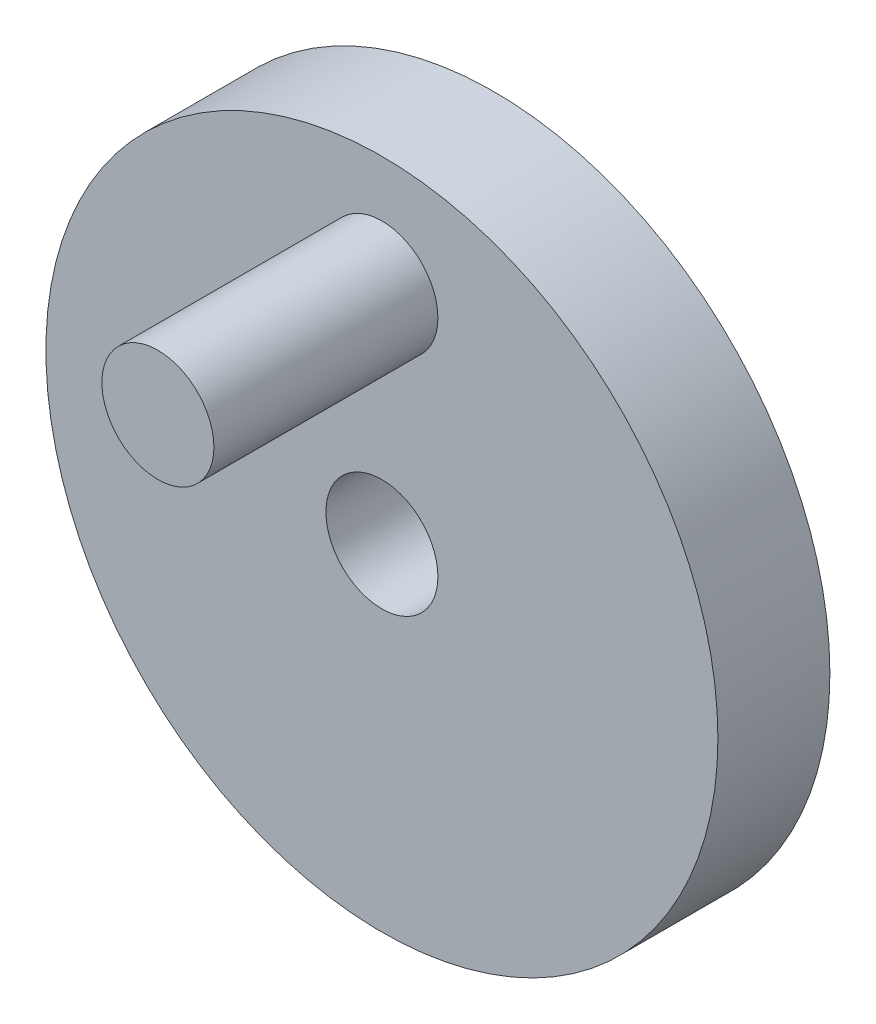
ISO-10303-21;
HEADER;
FILE_DESCRIPTION(('STEP AP214'),'2;1');
FILE_NAME('part.step','',(''),(''),'','','');
FILE_SCHEMA(('AUTOMOTIVE_DESIGN { 1 0 10303 214 1 1 1 1 }'));
ENDSEC;
DATA;
#1=APPLICATION_CONTEXT('core data for automotive mechanical design processes');
#2=APPLICATION_PROTOCOL_DEFINITION('international standard','automotive_design',2000,#1);
#3=PRODUCT_CONTEXT('',#1,'mechanical');
#4=PRODUCT('Part','Part','',(#3));
#5=PRODUCT_RELATED_PRODUCT_CATEGORY('part','',(#4));
#6=PRODUCT_DEFINITION_FORMATION('','',#4);
#7=PRODUCT_DEFINITION_CONTEXT('part definition',#1,'design');
#8=PRODUCT_DEFINITION('design','',#6,#7);
#9=PRODUCT_DEFINITION_SHAPE('','',#8);
#10=(LENGTH_UNIT() NAMED_UNIT(*) SI_UNIT(.MILLI.,.METRE.));
#11=(NAMED_UNIT(*) PLANE_ANGLE_UNIT() SI_UNIT($,.RADIAN.));
#12=(NAMED_UNIT(*) SI_UNIT($,.STERADIAN.) SOLID_ANGLE_UNIT());
#13=UNCERTAINTY_MEASURE_WITH_UNIT(LENGTH_MEASURE(1.E-05),#10,'distance_accuracy_value','');
#14=(GEOMETRIC_REPRESENTATION_CONTEXT(3) GLOBAL_UNCERTAINTY_ASSIGNED_CONTEXT((#13)) GLOBAL_UNIT_ASSIGNED_CONTEXT((#10,
#11,#12)) REPRESENTATION_CONTEXT('',''));
#15=CARTESIAN_POINT('',(0.,0.,0.));
#16=DIRECTION('',(0.,0.,1.));
#17=DIRECTION('',(1.,0.,0.));
#18=AXIS2_PLACEMENT_3D('',#15,#16,#17);
#19=CARTESIAN_POINT('',(0.,0.,10.));
#20=DIRECTION('',(0.,0.,1.));
#21=DIRECTION('',(1.,0.,0.));
#22=AXIS2_PLACEMENT_3D('',#19,#20,#21);
#23=PLANE('',#22);
#24=CARTESIAN_POINT('',(0.,0.,10.));
#25=DIRECTION('',(0.,0.,1.));
#26=DIRECTION('',(1.,0.,0.));
#27=AXIS2_PLACEMENT_3D('',#24,#25,#26);
#28=CIRCLE('',#27,30.);
#29=CARTESIAN_POINT('',(30.,0.,10.));
#30=VERTEX_POINT('',#29);
#31=EDGE_CURVE('E10',#30,#30,#28,.T.);
#32=ORIENTED_EDGE('',*,*,#31,.T.);
#33=EDGE_LOOP('',(#32));
#34=FACE_BOUND('',#33,.T.);
#35=CARTESIAN_POINT('',(0.,0.,10.));
#36=DIRECTION('',(0.,0.,1.));
#37=DIRECTION('',(1.,0.,0.));
#38=AXIS2_PLACEMENT_3D('',#35,#36,#37);
#39=CIRCLE('',#38,5.);
#40=CARTESIAN_POINT('',(5.,0.,10.));
#41=VERTEX_POINT('',#40);
#42=EDGE_CURVE('E45',#41,#41,#39,.T.);
#43=ORIENTED_EDGE('',*,*,#42,.F.);
#44=EDGE_LOOP('',(#43));
#45=FACE_BOUND('',#44,.T.);
#46=CARTESIAN_POINT('',(0.,20.,10.));
#47=DIRECTION('',(0.,0.,1.));
#48=DIRECTION('',(1.,0.,0.));
#49=AXIS2_PLACEMENT_3D('',#46,#47,#48);
#50=CIRCLE('',#49,5.);
#51=CARTESIAN_POINT('',(5.,20.,10.));
#52=VERTEX_POINT('',#51);
#53=EDGE_CURVE('E51',#52,#52,#50,.T.);
#54=ORIENTED_EDGE('',*,*,#53,.F.);
#55=EDGE_LOOP('',(#54));
#56=FACE_BOUND('',#55,.T.);
#57=ADVANCED_FACE('F32',(#34,#45,#56),#23,.T.);
#58=CARTESIAN_POINT('',(0.,0.,10.));
#59=DIRECTION('',(0.,0.,-1.));
#60=DIRECTION('',(-1.,0.,0.));
#61=AXIS2_PLACEMENT_3D('',#58,#59,#60);
#62=CYLINDRICAL_SURFACE('',#61,30.);
#63=ORIENTED_EDGE('',*,*,#31,.F.);
#64=EDGE_LOOP('',(#63));
#65=FACE_BOUND('',#64,.T.);
#66=CARTESIAN_POINT('',(0.,0.,0.));
#67=DIRECTION('',(0.,0.,1.));
#68=DIRECTION('',(1.,0.,0.));
#69=AXIS2_PLACEMENT_3D('',#66,#67,#68);
#70=CIRCLE('',#69,30.);
#71=CARTESIAN_POINT('',(30.,0.,0.));
#72=VERTEX_POINT('',#71);
#73=EDGE_CURVE('E36',#72,#72,#70,.T.);
#74=ORIENTED_EDGE('',*,*,#73,.T.);
#75=EDGE_LOOP('',(#74));
#76=FACE_BOUND('',#75,.T.);
#77=ADVANCED_FACE('F34',(#65,#76),#62,.T.);
#78=CARTESIAN_POINT('',(0.,0.,0.));
#79=DIRECTION('',(0.,0.,1.));
#80=DIRECTION('',(1.,0.,0.));
#81=AXIS2_PLACEMENT_3D('',#78,#79,#80);
#82=PLANE('',#81);
#83=CARTESIAN_POINT('',(0.,0.,0.));
#84=DIRECTION('',(0.,0.,1.));
#85=DIRECTION('',(1.,0.,0.));
#86=AXIS2_PLACEMENT_3D('',#83,#84,#85);
#87=CIRCLE('',#86,5.);
#88=CARTESIAN_POINT('',(5.,0.,0.));
#89=VERTEX_POINT('',#88);
#90=EDGE_CURVE('E43',#89,#89,#87,.T.);
#91=ORIENTED_EDGE('',*,*,#90,.T.);
#92=EDGE_LOOP('',(#91));
#93=FACE_BOUND('',#92,.T.);
#94=ORIENTED_EDGE('',*,*,#73,.F.);
#95=EDGE_LOOP('',(#94));
#96=FACE_BOUND('',#95,.T.);
#97=ADVANCED_FACE('F71',(#93,#96),#82,.F.);
#98=CARTESIAN_POINT('',(0.,0.,0.));
#99=DIRECTION('',(0.,0.,1.));
#100=DIRECTION('',(1.,0.,0.));
#101=AXIS2_PLACEMENT_3D('',#98,#99,#100);
#102=CYLINDRICAL_SURFACE('',#101,5.);
#103=ORIENTED_EDGE('',*,*,#90,.F.);
#104=EDGE_LOOP('',(#103));
#105=FACE_BOUND('',#104,.T.);
#106=ORIENTED_EDGE('',*,*,#42,.T.);
#107=EDGE_LOOP('',(#106));
#108=FACE_BOUND('',#107,.T.);
#109=ADVANCED_FACE('F62',(#105,#108),#102,.F.);
#110=CARTESIAN_POINT('',(0.,20.,30.));
#111=DIRECTION('',(0.,0.,-1.));
#112=DIRECTION('',(-1.,0.,0.));
#113=AXIS2_PLACEMENT_3D('',#110,#111,#112);
#114=CYLINDRICAL_SURFACE('',#113,5.);
#115=CARTESIAN_POINT('',(0.,20.,30.));
#116=DIRECTION('',(0.,0.,1.));
#117=DIRECTION('',(1.,0.,0.));
#118=AXIS2_PLACEMENT_3D('',#115,#116,#117);
#119=CIRCLE('',#118,5.);
#120=CARTESIAN_POINT('',(5.,20.,30.));
#121=VERTEX_POINT('',#120);
#122=EDGE_CURVE('E48',#121,#121,#119,.T.);
#123=ORIENTED_EDGE('',*,*,#122,.F.);
#124=EDGE_LOOP('',(#123));
#125=FACE_BOUND('',#124,.T.);
#126=ORIENTED_EDGE('',*,*,#53,.T.);
#127=EDGE_LOOP('',(#126));
#128=FACE_BOUND('',#127,.T.);
#129=ADVANCED_FACE('F59',(#125,#128),#114,.T.);
#130=CARTESIAN_POINT('',(0.,20.,30.));
#131=DIRECTION('',(0.,0.,1.));
#132=DIRECTION('',(1.,0.,0.));
#133=AXIS2_PLACEMENT_3D('',#130,#131,#132);
#134=PLANE('',#133);
#135=ORIENTED_EDGE('',*,*,#122,.T.);
#136=EDGE_LOOP('',(#135));
#137=FACE_BOUND('',#136,.T.);
#138=ADVANCED_FACE('F57',(#137),#134,.T.);
#139=CLOSED_SHELL('',(#57,#77,#97,#109,#129,#138));
#140=MANIFOLD_SOLID_BREP('B2',#139);
#141=ADVANCED_BREP_SHAPE_REPRESENTATION('',(#18,#140),#14);
#142=SHAPE_DEFINITION_REPRESENTATION(#9,#141);
ENDSEC;
END-ISO-10303-21;
